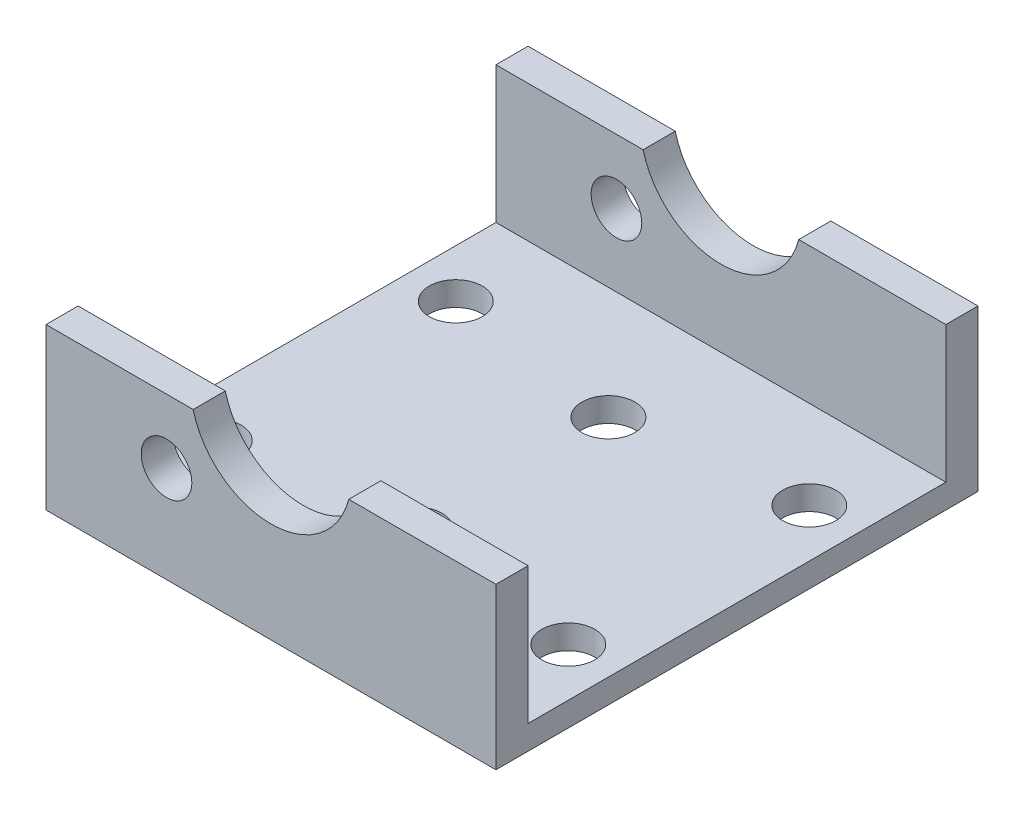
from build123d import *

# Parameters (mm, degrees)
ESQUISSE1_W             = 56
ESQUISSE1_H             = 20
EXTRUSION1_DEPTH        = 30
D_GAGEMENT_M61_D        = 6.6
ESQUISSE5_R             = 10
ENL_V_MAT_EXTRU_1_DEPTH = 75.893257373
ESQUISSE6_W             = 52
ESQUISSE6_H             = 17
ENL_V_MAT_EXTRU_2_DEPTH = 73.532751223
D_GAGEMENT_M62_D        = 6.6
ESQUISSE9_R             = 3.15
ENL_V_MAT_EXTRU_3_DEPTH = 75.893257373


with BuildPart() as part:
    # Esquisse1 → Extrusion1 (new, symmetric)
    with BuildSketch(Plane.XY):
        with Locations((0, 25)):
            Rectangle(ESQUISSE1_W, ESQUISSE1_H)
    extrude(amount=EXTRUSION1_DEPTH, both=True)

    # D_gagement M61 (through all)
    with Locations(Plane(origin=(0, 35, 0), x_dir=(-1, 0, 0), z_dir=(0, 1, 0))):
        with Locations((22, 15), (22, -15), (-22, -15), (-22, 15)):
            Hole(D_GAGEMENT_M61_D / 2)

    # Esquisse5 → Enl_v. mat.-Extru.1 (cut, through all)
    with BuildSketch(Plane.XY.offset(30)):
        with Locations((0, 37.5)):
            Circle(ESQUISSE5_R)
    extrude(amount=-ENL_V_MAT_EXTRU_1_DEPTH, mode=Mode.SUBTRACT)

    # Esquisse6 → Enl_v. mat.-Extru.2 (cut, through all)
    with BuildSketch(Plane.ZY.offset(28)):
        with Locations((0, 26.5)):
            Rectangle(ESQUISSE6_W, ESQUISSE6_H)
    extrude(amount=-ENL_V_MAT_EXTRU_2_DEPTH, mode=Mode.SUBTRACT)

    # D_gagement M62 (through all)
    with Locations(Plane(origin=(0, 18, 0), x_dir=(-1, 0, 0), z_dir=(0, 1, 0))):
        with Locations((0, 12), (0, -12)):
            Hole(D_GAGEMENT_M62_D / 2)

    # Esquisse9 → Enl_v. mat.-Extru.3 (cut, through all)
    with BuildSketch(Plane.XY.offset(30)):
        with Locations((-13, 27)):
            Circle(ESQUISSE9_R)
    extrude(amount=-ENL_V_MAT_EXTRU_3_DEPTH, mode=Mode.SUBTRACT)


solid = part.part
